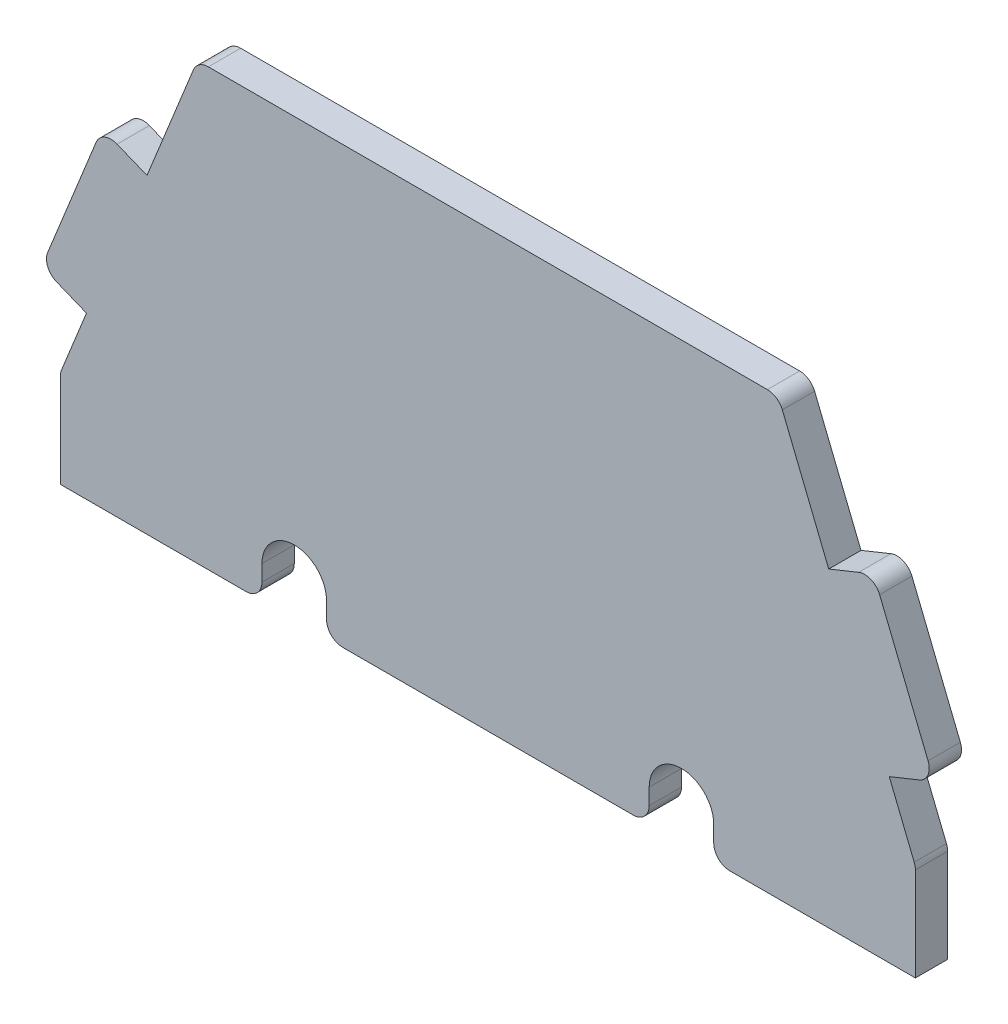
from build123d import *

# Parameters (mm, degrees)
RESSALTO_EXTRUS_O1_DEPTH = 2


with BuildPart() as part:
    # Esbo_o1 → Ressalto-extrus_o1 (new body)
    with BuildSketch(Plane.XY):
        with BuildLine():
            Line((-26.426946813, -7.319515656), (-24.880952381, -3.5))
            Line((-24.880952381, -3.5), (-26.734846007, -2.749614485))
            ThreePointArc((-26.734846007, -2.749614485), (-27.28040497, -2.212816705), (-27.286600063, -1.447474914))
            Line((-27.286600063, -1.447474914), (-24.285058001, 5.968099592))
            ThreePointArc((-24.285058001, 5.968099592), (-23.748260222, 6.513658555), (-22.98291843, 6.519853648))
            Line((-22.98291843, 6.519853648), (-21.129024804, 5.769468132))
            Line((-21.129024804, 5.769468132), (-18.252898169, 12.875192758))
            ThreePointArc((-18.252898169, 12.875192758), (-17.88488214, 13.329214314), (-17.325951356, 13.5))
            Line((-17.325951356, 13.5), (17.325951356, 13.5))
            ThreePointArc((17.325951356, 13.5), (17.88488214, 13.329214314), (18.252898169, 12.875192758))
            Line((18.252898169, 12.875192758), (21.129024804, 5.769468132))
            Line((21.129024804, 5.769468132), (22.98291843, 6.519853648))
            ThreePointArc((22.98291843, 6.519853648), (23.748260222, 6.513658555), (24.285058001, 5.968099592))
            Line((24.285058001, 5.968099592), (27.286600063, -1.447474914))
            ThreePointArc((27.286600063, -1.447474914), (27.28040497, -2.212816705), (26.734846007, -2.749614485))
            Line((26.734846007, -2.749614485), (24.880952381, -3.5))
            Line((24.880952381, -3.5), (26.426946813, -7.319515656))
            ThreePointArc((26.426946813, -7.319515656), (26.481566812, -7.503589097), (26.5, -7.694708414))
            Line((26.5, -7.694708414), (26.5, -13.5))
            Line((26.5, -13.5), (15, -13.5))
            ThreePointArc((15, -13.5), (14.292893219, -13.207106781), (14, -12.5))
            Line((14, -12.5), (14, -11.5))
            ThreePointArc((14, -11.5), (12, -9.5), (10, -11.5))
            Line((10, -11.5), (10, -12.5))
            ThreePointArc((10, -12.5), (9.707106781, -13.207106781), (9, -13.5))
            Line((9, -13.5), (-9, -13.5))
            ThreePointArc((-9, -13.5), (-9.707106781, -13.207106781), (-10, -12.5))
            Line((-10, -12.5), (-10, -11.5))
            ThreePointArc((-10, -11.5), (-12, -9.5), (-14, -11.5))
            Line((-14, -11.5), (-14, -12.5))
            ThreePointArc((-14, -12.5), (-14.292893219, -13.207106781), (-15, -13.5))
            Line((-15, -13.5), (-26.5, -13.5))
            Line((-26.5, -13.5), (-26.5, -7.694708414))
            ThreePointArc((-26.5, -7.694708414), (-26.481566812, -7.503589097), (-26.426946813, -7.319515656))
        make_face()
    extrude(amount=RESSALTO_EXTRUS_O1_DEPTH)


solid = part.part
